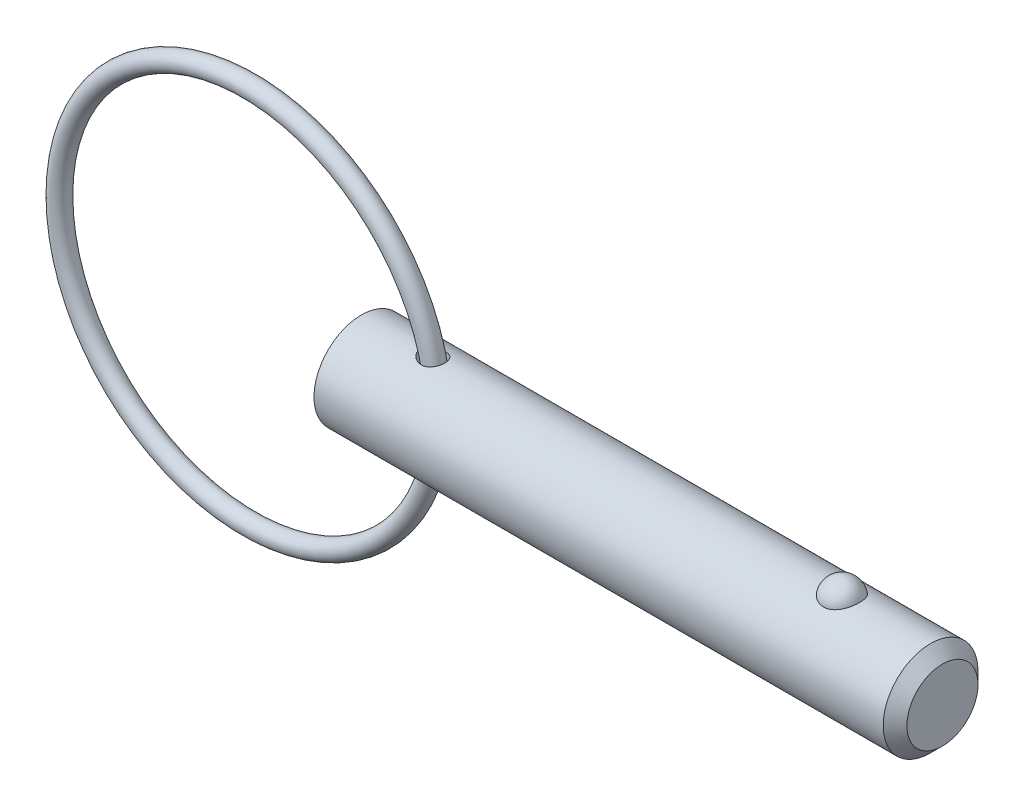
ISO-10303-21;
HEADER;
FILE_DESCRIPTION(('STEP AP214'),'2;1');
FILE_NAME('part.step','',(''),(''),'','','');
FILE_SCHEMA(('AUTOMOTIVE_DESIGN { 1 0 10303 214 1 1 1 1 }'));
ENDSEC;
DATA;
#1=APPLICATION_CONTEXT('core data for automotive mechanical design processes');
#2=APPLICATION_PROTOCOL_DEFINITION('international standard','automotive_design',2000,#1);
#3=PRODUCT_CONTEXT('',#1,'mechanical');
#4=PRODUCT('Part','Part','',(#3));
#5=PRODUCT_RELATED_PRODUCT_CATEGORY('part','',(#4));
#6=PRODUCT_DEFINITION_FORMATION('','',#4);
#7=PRODUCT_DEFINITION_CONTEXT('part definition',#1,'design');
#8=PRODUCT_DEFINITION('design','',#6,#7);
#9=PRODUCT_DEFINITION_SHAPE('','',#8);
#10=(LENGTH_UNIT() NAMED_UNIT(*) SI_UNIT(.MILLI.,.METRE.));
#11=(NAMED_UNIT(*) PLANE_ANGLE_UNIT() SI_UNIT($,.RADIAN.));
#12=(NAMED_UNIT(*) SI_UNIT($,.STERADIAN.) SOLID_ANGLE_UNIT());
#13=UNCERTAINTY_MEASURE_WITH_UNIT(LENGTH_MEASURE(1.E-05),#10,'distance_accuracy_value','');
#14=(GEOMETRIC_REPRESENTATION_CONTEXT(3) GLOBAL_UNCERTAINTY_ASSIGNED_CONTEXT((#13)) GLOBAL_UNIT_ASSIGNED_CONTEXT((#10,
#11,#12)) REPRESENTATION_CONTEXT('',''));
#15=CARTESIAN_POINT('',(0.,0.,0.));
#16=DIRECTION('',(0.,0.,1.));
#17=DIRECTION('',(1.,0.,0.));
#18=AXIS2_PLACEMENT_3D('',#15,#16,#17);
#19=CARTESIAN_POINT('',(-7.52490236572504,0.,0.));
#20=DIRECTION('',(0.,0.,1.));
#21=DIRECTION('',(1.,0.,0.));
#22=AXIS2_PLACEMENT_3D('',#19,#20,#21);
#23=TOROIDAL_SURFACE('',#22,12.7,0.635000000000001);
#24=CARTESIAN_POINT('',(5.81009763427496,0.,0.));
#25=VERTEX_POINT('',#24);
#26=VERTEX_LOOP('',#25);
#27=FACE_BOUND('',#26,.T.);
#28=ADVANCED_FACE('P0_F12',(#27),#23,.T.);
#29=CLOSED_SHELL('',(#28));
#30=MANIFOLD_SOLID_BREP('P0_B1',#29);
#31=CARTESIAN_POINT('',(0.,0.,0.));
#32=DIRECTION('',(1.,0.,0.));
#33=DIRECTION('',(0.,0.,-1.));
#34=AXIS2_PLACEMENT_3D('',#31,#32,#33);
#35=CYLINDRICAL_SURFACE('',#34,3.175);
#36=CARTESIAN_POINT('',(4.01221718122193,3.16142308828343,-0.293307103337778));
#37=CARTESIAN_POINT('',(4.03067993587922,3.15750982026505,-0.335477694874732));
#38=CARTESIAN_POINT('',(4.05297703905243,3.15289835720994,-0.375943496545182));
#39=CARTESIAN_POINT('',(4.10415276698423,3.14284099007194,-0.45240794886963));
#40=CARTESIAN_POINT('',(4.13304477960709,3.13739339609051,-0.488397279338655));
#41=CARTESIAN_POINT('',(4.19615348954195,3.12629932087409,-0.554988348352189));
#42=CARTESIAN_POINT('',(4.23034557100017,3.12065384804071,-0.585613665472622));
#43=CARTESIAN_POINT('',(4.30313282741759,3.10972452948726,-0.641123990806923));
#44=CARTESIAN_POINT('',(4.34172706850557,3.10444060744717,-0.666010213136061));
#45=CARTESIAN_POINT('',(4.42517725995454,3.09444053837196,-0.711079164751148));
#46=CARTESIAN_POINT('',(4.4702815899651,3.08978882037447,-0.730818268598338));
#47=CARTESIAN_POINT('',(4.56327045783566,3.08209858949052,-0.762602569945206));
#48=CARTESIAN_POINT('',(4.61115533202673,3.07906027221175,-0.774646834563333));
#49=CARTESIAN_POINT('',(4.70827322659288,3.0750396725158,-0.790458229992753));
#50=CARTESIAN_POINT('',(4.75750323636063,3.07405312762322,-0.794242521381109));
#51=CARTESIAN_POINT('',(4.85586074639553,3.07433427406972,-0.793155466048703));
#52=CARTESIAN_POINT('',(4.90498828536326,3.07560084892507,-0.788288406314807));
#53=CARTESIAN_POINT('',(4.99830385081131,3.08013122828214,-0.770385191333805));
#54=CARTESIAN_POINT('',(5.04260499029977,3.08325928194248,-0.757902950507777));
#55=CARTESIAN_POINT('',(5.12824625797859,3.09104671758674,-0.72548689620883));
#56=CARTESIAN_POINT('',(5.16958706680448,3.09570574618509,-0.705554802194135));
#57=CARTESIAN_POINT('',(5.24627719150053,3.10576748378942,-0.659813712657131));
#58=CARTESIAN_POINT('',(5.28181038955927,3.11112830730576,-0.634302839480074));
#59=CARTESIAN_POINT('',(5.34802604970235,3.12213947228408,-0.577667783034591));
#60=CARTESIAN_POINT('',(5.37870854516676,3.1277898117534,-0.54654363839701));
#61=CARTESIAN_POINT('',(5.43445707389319,3.13876145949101,-0.479533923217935));
#62=CARTESIAN_POINT('',(5.45951927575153,3.14408254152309,-0.443645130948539));
#63=CARTESIAN_POINT('',(5.50339935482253,3.15381660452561,-0.368122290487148));
#64=CARTESIAN_POINT('',(5.52221691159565,3.15822953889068,-0.328488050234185));
#65=CARTESIAN_POINT('',(5.55335622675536,3.16572312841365,-0.246075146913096));
#66=CARTESIAN_POINT('',(5.56559711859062,3.16878711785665,-0.20326439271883));
#67=CARTESIAN_POINT('',(5.58294807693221,3.17317503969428,-0.11613503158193));
#68=CARTESIAN_POINT('',(5.58805800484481,3.17449893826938,-0.0718163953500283));
#69=CARTESIAN_POINT('',(5.59103306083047,3.17526647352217,0.017234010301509));
#70=CARTESIAN_POINT('',(5.5888730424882,3.17470358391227,0.0619666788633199));
#71=CARTESIAN_POINT('',(5.57730300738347,3.17174350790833,0.150422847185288));
#72=CARTESIAN_POINT('',(5.56789286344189,3.16934628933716,0.194146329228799));
#73=CARTESIAN_POINT('',(5.54204285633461,3.16297605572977,0.279344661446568));
#74=CARTESIAN_POINT('',(5.52560272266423,3.15900298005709,0.320819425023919));
#75=CARTESIAN_POINT('',(5.48608205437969,3.14991364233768,0.400340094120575));
#76=CARTESIAN_POINT('',(5.46300145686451,3.14479736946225,0.438385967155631));
#77=CARTESIAN_POINT('',(5.41080575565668,3.1339965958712,0.509900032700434));
#78=CARTESIAN_POINT('',(5.3817004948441,3.12831302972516,0.543375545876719));
#79=CARTESIAN_POINT('',(5.31818122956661,3.11701107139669,0.604852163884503));
#80=CARTESIAN_POINT('',(5.2837678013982,3.11139267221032,0.632853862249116));
#81=CARTESIAN_POINT('',(5.21096127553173,3.10091904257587,0.682320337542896));
#82=CARTESIAN_POINT('',(5.17261393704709,3.09605639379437,0.703850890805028));
#83=CARTESIAN_POINT('',(5.09274050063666,3.08756769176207,0.740203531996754));
#84=CARTESIAN_POINT('',(5.05121474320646,3.08394150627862,0.755026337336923));
#85=CARTESIAN_POINT('',(4.96650658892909,3.07833156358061,0.777582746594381));
#86=CARTESIAN_POINT('',(4.92333841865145,3.07633606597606,0.785367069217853));
#87=CARTESIAN_POINT('',(4.83627503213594,3.07411756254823,0.794006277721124));
#88=CARTESIAN_POINT('',(4.79237971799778,3.07389479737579,0.794860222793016));
#89=CARTESIAN_POINT('',(4.7037564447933,3.0752087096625,0.789761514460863));
#90=CARTESIAN_POINT('',(4.65904075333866,3.07679607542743,0.783612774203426));
#91=CARTESIAN_POINT('',(4.57116325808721,3.08158486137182,0.764561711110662));
#92=CARTESIAN_POINT('',(4.52800197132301,3.08478681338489,0.751657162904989));
#93=CARTESIAN_POINT('',(4.44149370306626,3.09268658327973,0.718486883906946));
#94=CARTESIAN_POINT('',(4.39831651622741,3.0974680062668,0.697797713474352));
#95=CARTESIAN_POINT('',(4.31591226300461,3.10789270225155,0.649792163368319));
#96=CARTESIAN_POINT('',(4.27668695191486,3.11353635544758,0.622472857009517));
#97=CARTESIAN_POINT('',(4.20182407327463,3.1252888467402,0.560557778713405));
#98=CARTESIAN_POINT('',(4.16638921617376,3.13140725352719,0.525717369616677));
#99=CARTESIAN_POINT('',(4.10227951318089,3.14315144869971,0.450199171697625));
#100=CARTESIAN_POINT('',(4.07360231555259,3.14877740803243,0.409523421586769));
#101=CARTESIAN_POINT('',(4.02575866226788,3.15851130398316,0.32574192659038));
#102=CARTESIAN_POINT('',(4.00615248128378,3.16268619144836,0.282896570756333));
#103=CARTESIAN_POINT('',(3.97532986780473,3.16936826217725,0.194163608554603));
#104=CARTESIAN_POINT('',(3.96410589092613,3.17187694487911,0.148278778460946));
#105=CARTESIAN_POINT('',(3.95155037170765,3.17469339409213,0.0604600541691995));
#106=CARTESIAN_POINT('',(3.9492378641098,3.17521926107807,0.0186712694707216));
#107=CARTESIAN_POINT('',(3.95191506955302,3.1746144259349,-0.0646295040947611));
#108=CARTESIAN_POINT('',(3.9568961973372,3.17348567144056,-0.106141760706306));
#109=CARTESIAN_POINT('',(3.97060099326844,3.17043701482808,-0.172031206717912));
#110=CARTESIAN_POINT('',(3.97717137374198,3.16898333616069,-0.196902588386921));
#111=CARTESIAN_POINT('',(3.99283717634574,3.16556630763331,-0.245794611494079));
#112=CARTESIAN_POINT('',(4.00193224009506,3.16360303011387,-0.269815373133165));
#113=CARTESIAN_POINT('',(4.01221718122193,3.16142308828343,-0.293307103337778));
#114=B_SPLINE_CURVE_WITH_KNOTS('',3,(#36,#37,#38,#39,#40,#41,#42,#43,#44,#45,#46,#47,#48,#49,
#50,#51,#52,#53,#54,#55,#56,#57,#58,#59,#60,#61,#62,#63,#64,#65,#66,#67,#68,#69,#70,#71,#72,#73,
#74,#75,#76,#77,#78,#79,#80,#81,#82,#83,#84,#85,#86,#87,#88,#89,#90,#91,#92,#93,#94,#95,#96,#97,
#98,#99,#100,#101,#102,#103,#104,#105,#106,#107,#108,#109,#110,#111,#112,#113),.UNSPECIFIED.,
.T.,.F.,(4,2,2,2,2,2,2,2,2,2,2,2,2,2,2,2,2,2,2,2,2,2,2,2,2,2,2,2,2,2,2,2,2,2,2,2,2,2,4),(0.,
0.138498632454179,0.277280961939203,0.415437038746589,0.553563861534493,0.701231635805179,
0.848917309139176,0.996295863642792,1.14360140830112,1.28129260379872,1.41895203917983,
1.55053732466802,1.68212170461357,1.81379551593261,1.9454760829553,2.07874074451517,
2.21200799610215,2.34573668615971,2.47946772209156,2.61320390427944,2.74694135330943,
2.8804620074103,3.01396817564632,3.14606745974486,3.27815261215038,3.40927820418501,
3.54042159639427,3.6753294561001,3.81028178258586,3.95399377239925,4.09776931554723,
4.24721954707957,4.39661769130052,4.53771923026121,4.67869361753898,4.80361432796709,
4.92838811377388,5.00555170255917,5.08270434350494),.UNSPECIFIED.);
#115=CARTESIAN_POINT('',(4.01221718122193,3.16142308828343,-0.293307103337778));
#116=VERTEX_POINT('',#115);
#117=EDGE_CURVE('P1_E40',#116,#116,#114,.T.);
#118=ORIENTED_EDGE('',*,*,#117,.T.);
#119=EDGE_LOOP('',(#118));
#120=FACE_BOUND('',#119,.T.);
#121=CARTESIAN_POINT('',(38.11625,0.,0.));
#122=DIRECTION('',(1.,0.,0.));
#123=DIRECTION('',(0.,0.,-1.));
#124=AXIS2_PLACEMENT_3D('',#121,#122,#123);
#125=CIRCLE('',#124,3.175);
#126=CARTESIAN_POINT('',(38.11625,0.,-3.175));
#127=VERTEX_POINT('',#126);
#128=EDGE_CURVE('P1_E25',#127,#127,#125,.T.);
#129=ORIENTED_EDGE('',*,*,#128,.F.);
#130=EDGE_LOOP('',(#129));
#131=FACE_BOUND('',#130,.T.);
#132=CARTESIAN_POINT('',(0.,0.,0.));
#133=DIRECTION('',(1.,0.,0.));
#134=DIRECTION('',(0.,0.,-1.));
#135=AXIS2_PLACEMENT_3D('',#132,#133,#134);
#136=CIRCLE('',#135,3.175);
#137=CARTESIAN_POINT('',(0.,0.,-3.175));
#138=VERTEX_POINT('',#137);
#139=EDGE_CURVE('P1_E9',#138,#138,#136,.T.);
#140=ORIENTED_EDGE('',*,*,#139,.T.);
#141=EDGE_LOOP('',(#140));
#142=FACE_BOUND('',#141,.T.);
#143=CARTESIAN_POINT('',(32.1757276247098,2.92898950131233,1.2254164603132));
#144=CARTESIAN_POINT('',(32.112316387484,2.92899434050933,1.22541146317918));
#145=CARTESIAN_POINT('',(32.0487979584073,2.93112688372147,1.2203464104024));
#146=CARTESIAN_POINT('',(31.9235306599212,2.93942752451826,1.20020949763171));
#147=CARTESIAN_POINT('',(31.8617869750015,2.9456063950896,1.18511092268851));
#148=CARTESIAN_POINT('',(31.7420651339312,2.96127115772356,1.14540352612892));
#149=CARTESIAN_POINT('',(31.6840775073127,2.97074831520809,1.12081980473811));
#150=CARTESIAN_POINT('',(31.5731943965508,2.99197584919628,1.06285154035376));
#151=CARTESIAN_POINT('',(31.5202966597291,3.0037252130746,1.02947091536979));
#152=CARTESIAN_POINT('',(31.4192688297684,3.02865714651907,0.953674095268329));
#153=CARTESIAN_POINT('',(31.371324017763,3.04187163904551,0.911021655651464));
#154=CARTESIAN_POINT('',(31.2830360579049,3.06808741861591,0.818400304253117));
#155=CARTESIAN_POINT('',(31.2426952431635,3.08108863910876,0.768429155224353));
#156=CARTESIAN_POINT('',(31.1688039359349,3.10614903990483,0.660064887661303));
#157=CARTESIAN_POINT('',(31.1356330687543,3.11814104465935,0.601396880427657));
#158=CARTESIAN_POINT('',(31.0791190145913,3.13926931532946,0.479026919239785));
#159=CARTESIAN_POINT('',(31.0557764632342,3.14840539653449,0.415324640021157));
#160=CARTESIAN_POINT('',(31.0191785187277,3.16298160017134,0.283885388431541));
#161=CARTESIAN_POINT('',(31.0060407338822,3.16837855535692,0.216110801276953));
#162=CARTESIAN_POINT('',(30.9905676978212,3.17475386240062,0.0791367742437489));
#163=CARTESIAN_POINT('',(30.988232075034,3.17573236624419,0.00993738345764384));
#164=CARTESIAN_POINT('',(30.994388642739,3.17318075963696,-0.127420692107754));
#165=CARTESIAN_POINT('',(31.0028073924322,3.16968122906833,-0.195583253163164));
#166=CARTESIAN_POINT('',(31.0301752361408,3.1585790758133,-0.329413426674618));
#167=CARTESIAN_POINT('',(31.0491245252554,3.15097637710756,-0.395080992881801));
#168=CARTESIAN_POINT('',(31.0972057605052,3.13242485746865,-0.522180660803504));
#169=CARTESIAN_POINT('',(31.1263524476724,3.12147119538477,-0.583606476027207));
#170=CARTESIAN_POINT('',(31.1942352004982,3.09734973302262,-0.700436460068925));
#171=CARTESIAN_POINT('',(31.232972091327,3.08418174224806,-0.755840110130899));
#172=CARTESIAN_POINT('',(31.3194771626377,3.05694884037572,-0.859404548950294));
#173=CARTESIAN_POINT('',(31.3672961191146,3.04287919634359,-0.907521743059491));
#174=CARTESIAN_POINT('',(31.4707353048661,3.01548927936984,-0.994758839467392));
#175=CARTESIAN_POINT('',(31.5263549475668,3.0021689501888,-1.03387941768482));
#176=CARTESIAN_POINT('',(31.6428093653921,2.97810316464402,-1.10126594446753));
#177=CARTESIAN_POINT('',(31.7035182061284,2.96731170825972,-1.12973256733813));
#178=CARTESIAN_POINT('',(31.8293712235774,2.94928934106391,-1.17598467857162));
#179=CARTESIAN_POINT('',(31.8945137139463,2.94205708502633,-1.19377420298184));
#180=CARTESIAN_POINT('',(32.0238562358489,2.93233065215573,-1.21746387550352));
#181=CARTESIAN_POINT('',(32.0879385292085,2.92961621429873,-1.22391763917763));
#182=CARTESIAN_POINT('',(32.2163375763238,2.92855752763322,-1.22644976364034));
#183=CARTESIAN_POINT('',(32.2806542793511,2.93021238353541,-1.22253024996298));
#184=CARTESIAN_POINT('',(32.4055239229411,2.9375685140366,-1.20474140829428));
#185=CARTESIAN_POINT('',(32.466131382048,2.94313790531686,-1.19119621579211));
#186=CARTESIAN_POINT('',(32.5841106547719,2.95756226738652,-1.15491492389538));
#187=CARTESIAN_POINT('',(32.6414822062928,2.96641750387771,-1.13217808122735));
#188=CARTESIAN_POINT('',(32.7527699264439,2.98669918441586,-1.07755083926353));
#189=CARTESIAN_POINT('',(32.8065845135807,2.9981771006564,-1.04547308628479));
#190=CARTESIAN_POINT('',(32.9081473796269,3.02240235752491,-0.973220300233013));
#191=CARTESIAN_POINT('',(32.9558942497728,3.03514999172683,-0.933043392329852));
#192=CARTESIAN_POINT('',(33.0465817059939,3.06131230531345,-0.843372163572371));
#193=CARTESIAN_POINT('',(33.0891588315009,3.07472822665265,-0.793510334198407));
#194=CARTESIAN_POINT('',(33.1656765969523,3.10021106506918,-0.687241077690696));
#195=CARTESIAN_POINT('',(33.1996156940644,3.1122777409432,-0.630832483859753));
#196=CARTESIAN_POINT('',(33.2591209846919,3.134208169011,-0.511059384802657));
#197=CARTESIAN_POINT('',(33.2843892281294,3.14399040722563,-0.447531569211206));
#198=CARTESIAN_POINT('',(33.3245117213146,3.15983820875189,-0.316827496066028));
#199=CARTESIAN_POINT('',(33.3393659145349,3.16590375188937,-0.249651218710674));
#200=CARTESIAN_POINT('',(33.358358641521,3.17370076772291,-0.113549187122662));
#201=CARTESIAN_POINT('',(33.3624966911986,3.17543204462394,-0.0446233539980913));
#202=CARTESIAN_POINT('',(33.3599697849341,3.17438372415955,0.0929938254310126));
#203=CARTESIAN_POINT('',(33.3533050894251,3.17160423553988,0.161685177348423));
#204=CARTESIAN_POINT('',(33.3293754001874,3.1618438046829,0.296502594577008));
#205=CARTESIAN_POINT('',(33.3121674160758,3.15488546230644,0.362640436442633));
#206=CARTESIAN_POINT('',(33.267547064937,3.13748892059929,0.490896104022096));
#207=CARTESIAN_POINT('',(33.2401339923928,3.12705048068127,0.553013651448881));
#208=CARTESIAN_POINT('',(33.1754626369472,3.10369139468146,0.671876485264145));
#209=CARTESIAN_POINT('',(33.1381467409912,3.0907563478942,0.728587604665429));
#210=CARTESIAN_POINT('',(33.0545246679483,3.06381731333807,0.834653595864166));
#211=CARTESIAN_POINT('',(33.0082189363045,3.04981337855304,0.884008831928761));
#212=CARTESIAN_POINT('',(32.9077184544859,3.02230423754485,0.973916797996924));
#213=CARTESIAN_POINT('',(32.853535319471,3.00879833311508,1.01448227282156));
#214=CARTESIAN_POINT('',(32.7385299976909,2.98383625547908,1.0857155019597));
#215=CARTESIAN_POINT('',(32.6777053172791,2.9723808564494,1.11637952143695));
#216=CARTESIAN_POINT('',(32.5533690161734,2.95329063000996,1.16592590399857));
#217=CARTESIAN_POINT('',(32.4900230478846,2.9455373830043,1.18517901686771));
#218=CARTESIAN_POINT('',(32.3607664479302,2.9342556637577,1.21284802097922));
#219=CARTESIAN_POINT('',(32.2948641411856,2.93071450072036,1.2212964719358));
#220=CARTESIAN_POINT('',(32.211116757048,2.9291525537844,1.22502505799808));
#221=CARTESIAN_POINT('',(32.1934263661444,2.92898815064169,1.22541785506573));
#222=CARTESIAN_POINT('',(32.1757276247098,2.92898950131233,1.2254164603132));
#223=B_SPLINE_CURVE_WITH_KNOTS('',3,(#143,#144,#145,#146,#147,#148,#149,#150,#151,#152,#153,
#154,#155,#156,#157,#158,#159,#160,#161,#162,#163,#164,#165,#166,#167,#168,#169,#170,#171,#172,
#173,#174,#175,#176,#177,#178,#179,#180,#181,#182,#183,#184,#185,#186,#187,#188,#189,#190,#191,
#192,#193,#194,#195,#196,#197,#198,#199,#200,#201,#202,#203,#204,#205,#206,#207,#208,#209,#210,
#211,#212,#213,#214,#215,#216,#217,#218,#219,#220,#221,#222),.UNSPECIFIED.,.T.,.F.,(4,2,2,2,2,2,
2,2,2,2,2,2,2,2,2,2,2,2,2,2,2,2,2,2,2,2,2,2,2,2,2,2,2,2,2,2,2,2,2,4),(0.,0.190186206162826,
0.380880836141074,0.571074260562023,0.761183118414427,0.956866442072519,1.1526097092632,
1.35701770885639,1.56143892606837,1.76818248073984,1.97491892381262,2.18025109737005,
2.38558707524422,2.59122111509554,2.79687285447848,3.00371012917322,3.2105318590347,
3.41323429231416,3.61586005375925,3.80828192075,4.00066436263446,4.18685798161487,
4.37306665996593,4.56330302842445,4.75358348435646,4.95345287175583,5.15335793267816,
5.35957003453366,5.56578325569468,5.7720057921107,5.97822335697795,6.183335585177,
6.38846199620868,6.59480900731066,6.80114579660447,7.00718137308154,7.21329457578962,
7.41228022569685,7.61066481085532,7.66374777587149),.UNSPECIFIED.);
#224=CARTESIAN_POINT('',(32.1757276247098,2.92898950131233,1.2254164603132));
#225=VERTEX_POINT('',#224);
#226=EDGE_CURVE('P1_E34',#225,#225,#223,.T.);
#227=ORIENTED_EDGE('',*,*,#226,.T.);
#228=EDGE_LOOP('',(#227));
#229=FACE_BOUND('',#228,.T.);
#230=CARTESIAN_POINT('',(4.01221718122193,-3.16142308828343,-0.293307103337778));
#231=CARTESIAN_POINT('',(3.99616924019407,-3.16482429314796,-0.256648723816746));
#232=CARTESIAN_POINT('',(3.98300872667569,-3.16769953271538,-0.218679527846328));
#233=CARTESIAN_POINT('',(3.96305928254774,-3.17210414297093,-0.141027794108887));
#234=CARTESIAN_POINT('',(3.95626715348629,-3.17363418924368,-0.101346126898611));
#235=CARTESIAN_POINT('',(3.94940055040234,-3.17518116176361,-0.0213063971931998));
#236=CARTESIAN_POINT('',(3.94933713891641,-3.17519559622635,0.019052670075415));
#237=CARTESIAN_POINT('',(3.95595884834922,-3.173703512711,0.0991848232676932));
#238=CARTESIAN_POINT('',(3.96264478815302,-3.17219681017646,0.138957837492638));
#239=CARTESIAN_POINT('',(3.98225001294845,-3.16786598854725,0.216153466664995));
#240=CARTESIAN_POINT('',(3.99506606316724,-3.16506371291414,0.253603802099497));
#241=CARTESIAN_POINT('',(4.0263107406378,-3.15843101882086,0.325977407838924));
#242=CARTESIAN_POINT('',(4.04474073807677,-3.15460034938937,0.360900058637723));
#243=CARTESIAN_POINT('',(4.08796442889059,-3.14597426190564,0.429836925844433));
#244=CARTESIAN_POINT('',(4.11310717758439,-3.1411307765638,0.463625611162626));
#245=CARTESIAN_POINT('',(4.16818460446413,-3.13112506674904,0.526983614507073));
#246=CARTESIAN_POINT('',(4.19812149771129,-3.1259626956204,0.556550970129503));
#247=CARTESIAN_POINT('',(4.26550089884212,-3.11521604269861,0.614003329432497));
#248=CARTESIAN_POINT('',(4.3034063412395,-3.10964747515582,0.641349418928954));
#249=CARTESIAN_POINT('',(4.38313680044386,-3.09926692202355,0.68977116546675));
#250=CARTESIAN_POINT('',(4.42496355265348,-3.09445527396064,0.710844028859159));
#251=CARTESIAN_POINT('',(4.5141785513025,-3.08586578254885,0.747282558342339));
#252=CARTESIAN_POINT('',(4.5617504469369,-3.08216903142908,0.762221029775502));
#253=CARTESIAN_POINT('',(4.65884938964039,-3.076742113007,0.783842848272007));
#254=CARTESIAN_POINT('',(4.7083760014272,-3.07501151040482,0.790528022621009));
#255=CARTESIAN_POINT('',(4.80630979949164,-3.07383938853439,0.7950736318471));
#256=CARTESIAN_POINT('',(4.85470314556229,-3.07432752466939,0.793205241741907));
#257=CARTESIAN_POINT('',(4.95034305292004,-3.07744489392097,0.781023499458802));
#258=CARTESIAN_POINT('',(4.99759012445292,-3.0800731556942,0.770713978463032));
#259=CARTESIAN_POINT('',(5.08626194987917,-3.08693276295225,0.742738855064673));
#260=CARTESIAN_POINT('',(5.1278649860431,-3.09104603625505,0.725607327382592));
#261=CARTESIAN_POINT('',(5.20739903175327,-3.10040746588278,0.684500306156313));
#262=CARTESIAN_POINT('',(5.24533051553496,-3.10565547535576,0.660525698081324));
#263=CARTESIAN_POINT('',(5.31542898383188,-3.11652031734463,0.607160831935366));
#264=CARTESIAN_POINT('',(5.34772618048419,-3.12212297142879,0.577938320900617));
#265=CARTESIAN_POINT('',(5.40696901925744,-3.13320503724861,0.514477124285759));
#266=CARTESIAN_POINT('',(5.43391452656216,-3.13868444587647,0.480238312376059));
#267=CARTESIAN_POINT('',(5.4820017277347,-3.14897211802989,0.407384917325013));
#268=CARTESIAN_POINT('',(5.50309185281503,-3.15377424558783,0.368735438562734));
#269=CARTESIAN_POINT('',(5.53866240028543,-3.16213411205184,0.288380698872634));
#270=CARTESIAN_POINT('',(5.55314252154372,-3.16569179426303,0.246675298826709));
#271=CARTESIAN_POINT('',(5.57526489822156,-3.17121134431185,0.160950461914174));
#272=CARTESIAN_POINT('',(5.58283917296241,-3.17315732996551,0.116912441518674));
#273=CARTESIAN_POINT('',(5.59072863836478,-3.17518554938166,0.0281485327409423));
#274=CARTESIAN_POINT('',(5.59104374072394,-3.17526776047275,-0.0165773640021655));
#275=CARTESIAN_POINT('',(5.58440302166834,-3.17355847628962,-0.105510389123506));
#276=CARTESIAN_POINT('',(5.57743745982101,-3.17176447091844,-0.149716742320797));
#277=CARTESIAN_POINT('',(5.55638330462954,-3.16649194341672,-0.23629572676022));
#278=CARTESIAN_POINT('',(5.54229454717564,-3.16301338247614,-0.278668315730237));
#279=CARTESIAN_POINT('',(5.50732506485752,-3.15474878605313,-0.360378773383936));
#280=CARTESIAN_POINT('',(5.48644386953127,-3.14996266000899,-0.399716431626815));
#281=CARTESIAN_POINT('',(5.43839310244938,-3.13960947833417,-0.474229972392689));
#282=CARTESIAN_POINT('',(5.41122365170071,-3.1340424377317,-0.509405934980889));
#283=CARTESIAN_POINT('',(5.35140258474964,-3.12277449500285,-0.574449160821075));
#284=CARTESIAN_POINT('',(5.31877354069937,-3.11707422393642,-0.604337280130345));
#285=CARTESIAN_POINT('',(5.24883067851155,-3.10616541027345,-0.658116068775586));
#286=CARTESIAN_POINT('',(5.21151752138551,-3.1009567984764,-0.682007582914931));
#287=CARTESIAN_POINT('',(5.13375489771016,-3.09168295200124,-0.722881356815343));
#288=CARTESIAN_POINT('',(5.09335030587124,-3.0876042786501,-0.739946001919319));
#289=CARTESIAN_POINT('',(5.01017421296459,-3.08094605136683,-0.767199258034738));
#290=CARTESIAN_POINT('',(4.96740279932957,-3.07836644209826,-0.777388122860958));
#291=CARTESIAN_POINT('',(4.88066362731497,-3.07495302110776,-0.790782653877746));
#292=CARTESIAN_POINT('',(4.8366943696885,-3.07412150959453,-0.793979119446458));
#293=CARTESIAN_POINT('',(4.74880185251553,-3.07424620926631,-0.79349509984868));
#294=CARTESIAN_POINT('',(4.70487860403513,-3.07520278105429,-0.789813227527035));
#295=CARTESIAN_POINT('',(4.61626456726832,-3.07882608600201,-0.775571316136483));
#296=CARTESIAN_POINT('',(4.571624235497,-3.08156578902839,-0.764717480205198));
#297=CARTESIAN_POINT('',(4.48464592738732,-3.08847909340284,-0.736297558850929));
#298=CARTESIAN_POINT('',(4.44230893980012,-3.09265330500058,-0.718728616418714));
#299=CARTESIAN_POINT('',(4.35823256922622,-3.10228551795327,-0.675988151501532));
#300=CARTESIAN_POINT('',(4.31671586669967,-3.10780992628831,-0.650392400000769));
#301=CARTESIAN_POINT('',(4.23853942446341,-3.11932897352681,-0.592684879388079));
#302=CARTESIAN_POINT('',(4.20188053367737,-3.12532369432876,-0.560571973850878));
#303=CARTESIAN_POINT('',(4.13583653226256,-3.13687565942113,-0.491740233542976));
#304=CARTESIAN_POINT('',(4.10623659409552,-3.14244088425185,-0.455229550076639));
#305=CARTESIAN_POINT('',(4.05384351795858,-3.1527191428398,-0.377513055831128));
#306=CARTESIAN_POINT('',(4.03104346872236,-3.1574330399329,-0.336312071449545));
#307=CARTESIAN_POINT('',(4.01221718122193,-3.16142308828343,-0.293307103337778));
#308=B_SPLINE_CURVE_WITH_KNOTS('',3,(#230,#231,#232,#233,#234,#235,#236,#237,#238,#239,#240,
#241,#242,#243,#244,#245,#246,#247,#248,#249,#250,#251,#252,#253,#254,#255,#256,#257,#258,#259,
#260,#261,#262,#263,#264,#265,#266,#267,#268,#269,#270,#271,#272,#273,#274,#275,#276,#277,#278,
#279,#280,#281,#282,#283,#284,#285,#286,#287,#288,#289,#290,#291,#292,#293,#294,#295,#296,#297,
#298,#299,#300,#301,#302,#303,#304,#305,#306,#307),.UNSPECIFIED.,.T.,.F.,(4,2,2,2,2,2,2,2,2,2,2,
2,2,2,2,2,2,2,2,2,2,2,2,2,2,2,2,2,2,2,2,2,2,2,2,2,2,2,4),(0.,0.120338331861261,
0.240616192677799,0.361091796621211,0.481582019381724,0.60011096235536,0.718668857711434,
0.845336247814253,0.972062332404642,1.1126676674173,1.25333552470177,1.40259505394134,
1.55182153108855,1.69635040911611,1.84081372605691,1.97568175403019,2.11053233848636,
2.24166080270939,2.37279256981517,2.50504501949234,2.63730349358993,2.77085027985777,
2.90439869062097,3.03812599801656,3.17185638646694,3.30559603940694,3.43933311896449,
3.57253035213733,3.70570880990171,3.83722775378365,3.96874184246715,4.10042887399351,
4.23214246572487,4.36961700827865,4.5071501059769,4.65373408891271,4.80034365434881,
4.94166003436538,5.08283228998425),.UNSPECIFIED.);
#309=CARTESIAN_POINT('',(4.01221718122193,-3.16142308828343,-0.293307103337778));
#310=VERTEX_POINT('',#309);
#311=EDGE_CURVE('P1_E17',#310,#310,#308,.T.);
#312=ORIENTED_EDGE('',*,*,#311,.T.);
#313=EDGE_LOOP('',(#312));
#314=FACE_BOUND('',#313,.T.);
#315=ADVANCED_FACE('P1_F13',(#120,#131,#142,#229,#314),#35,.T.);
#316=CARTESIAN_POINT('',(0.,0.,0.));
#317=DIRECTION('',(-1.,0.,0.));
#318=DIRECTION('',(0.,0.,1.));
#319=AXIS2_PLACEMENT_3D('',#316,#317,#318);
#320=PLANE('',#319);
#321=ORIENTED_EDGE('',*,*,#139,.F.);
#322=EDGE_LOOP('',(#321));
#323=FACE_BOUND('',#322,.T.);
#324=ADVANCED_FACE('P1_F15',(#323),#320,.T.);
#325=CARTESIAN_POINT('',(38.91,0.,0.));
#326=DIRECTION('',(-1.,0.,0.));
#327=DIRECTION('',(0.,0.,1.));
#328=AXIS2_PLACEMENT_3D('',#325,#326,#327);
#329=CONICAL_SURFACE('',#328,2.38125,0.785398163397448);
#330=ORIENTED_EDGE('',*,*,#128,.T.);
#331=EDGE_LOOP('',(#330));
#332=FACE_BOUND('',#331,.T.);
#333=CARTESIAN_POINT('',(38.91,0.,0.));
#334=DIRECTION('',(1.,0.,0.));
#335=DIRECTION('',(0.,0.,-1.));
#336=AXIS2_PLACEMENT_3D('',#333,#334,#335);
#337=CIRCLE('',#336,2.38125);
#338=CARTESIAN_POINT('',(38.91,0.,-2.38125));
#339=VERTEX_POINT('',#338);
#340=EDGE_CURVE('P1_E30',#339,#339,#337,.T.);
#341=ORIENTED_EDGE('',*,*,#340,.F.);
#342=EDGE_LOOP('',(#341));
#343=FACE_BOUND('',#342,.T.);
#344=ADVANCED_FACE('P1_F55',(#332,#343),#329,.T.);
#345=CARTESIAN_POINT('',(38.91,2.38125,0.));
#346=DIRECTION('',(1.,0.,0.));
#347=DIRECTION('',(0.,0.,-1.));
#348=AXIS2_PLACEMENT_3D('',#345,#346,#347);
#349=PLANE('',#348);
#350=ORIENTED_EDGE('',*,*,#340,.T.);
#351=EDGE_LOOP('',(#350));
#352=FACE_BOUND('',#351,.T.);
#353=ADVANCED_FACE('P1_F51',(#352),#349,.T.);
#354=CARTESIAN_POINT('',(32.1757276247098,2.8575,0.));
#355=DIRECTION('',(-1.,0.,0.));
#356=DIRECTION('',(0.,1.,0.));
#357=AXIS2_PLACEMENT_3D('',#354,#355,#356);
#358=SPHERICAL_SURFACE('',#357,1.22750000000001);
#359=ORIENTED_EDGE('',*,*,#226,.F.);
#360=EDGE_LOOP('',(#359));
#361=FACE_BOUND('',#360,.T.);
#362=ADVANCED_FACE('P1_F46',(#361),#358,.T.);
#363=CARTESIAN_POINT('',(-7.52490236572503,0.,0.));
#364=DIRECTION('',(0.,0.,1.));
#365=DIRECTION('',(1.,0.,0.));
#366=AXIS2_PLACEMENT_3D('',#363,#364,#365);
#367=TOROIDAL_SURFACE('',#366,12.7,0.79375);
#368=ORIENTED_EDGE('',*,*,#311,.F.);
#369=EDGE_LOOP('',(#368));
#370=FACE_BOUND('',#369,.T.);
#371=ORIENTED_EDGE('',*,*,#117,.F.);
#372=EDGE_LOOP('',(#371));
#373=FACE_BOUND('',#372,.T.);
#374=ADVANCED_FACE('P1_F50',(#370,#373),#367,.F.);
#375=CLOSED_SHELL('',(#315,#324,#344,#353,#362,#374));
#376=MANIFOLD_SOLID_BREP('P1_B1',#375);
#377=ADVANCED_BREP_SHAPE_REPRESENTATION('',(#18,#30,#376),#14);
#378=SHAPE_DEFINITION_REPRESENTATION(#9,#377);
ENDSEC;
END-ISO-10303-21;
